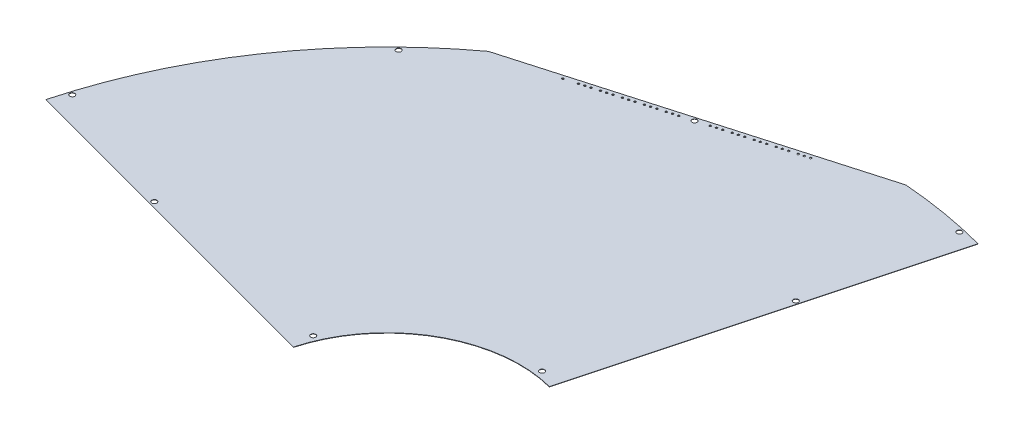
from build123d import *

# Parameters (mm, degrees)
SKETCH1_R      = 2
EXTRUDE1_DEPTH = 0.29
SKETCH2_R      = 0.75
EXTRUDE2_DEPTH = 529.801239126


with BuildPart() as part:
    # Sketch1 → Extrude1 (new body)
    with BuildSketch(Plane(origin=(0, 0, 0), x_dir=(1, 0, 0), z_dir=(0, 1, 0))):
        with BuildLine():
            Line((29.528359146, 379.854019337), (-226.333431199, 306.486831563))
            ThreePointArc((-226.333431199, 306.486831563), (-314.686889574, 214.786315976), (-367.888013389, 99.092934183))
            Line((-367.888013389, 99.092934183), (-101.29165232, 27.658654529))
            ThreePointArc((-101.29165232, 27.658654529), (-52.5, 90.932667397), (26.692728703, 101.550471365))
            Line((26.692728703, 101.550471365), (98.127008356, 368.146832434))
            ThreePointArc((98.127008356, 368.146832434), (64.095536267, 375.569916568), (29.528359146, 379.854019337))
        make_face()
        with Locations(Location((-360.801175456, 112.723164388, 0), (0, 0, 270))):
            Circle(SKETCH1_R, mode=Mode.SUBTRACT)
        with Locations(Location((-262.580864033, 271.910444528, 0), (0, 0, 270))):
            Circle(SKETCH1_R, mode=Mode.SUBTRACT)
        with Locations(Location((-101.180022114, 43.157886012, 0), (0, 0, 270))):
            Circle(SKETCH1_R, mode=Mode.SUBTRACT)
        with Locations(Location((-97.575623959, 340.286640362, 0), (0, 0, 270))):
            Circle(SKETCH1_R, mode=Mode.SUBTRACT)
        with Locations(Location((13.214185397, 109.203412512, 0), (0, 0, 270))):
            Circle(SKETCH1_R, mode=Mode.SUBTRACT)
        with Locations(Location((82.779463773, 368.824565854, 0), (0, 0, 270))):
            Circle(SKETCH1_R, mode=Mode.SUBTRACT)
        with Locations(Location((65.311626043, 257.269268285, 0), (0, 0, 270))):
            Circle(SKETCH1_R, mode=Mode.SUBTRACT)
        with Locations(Location((-255.457534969, 72.073106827, 0), (0, 0, 270))):
            Circle(SKETCH1_R, mode=Mode.SUBTRACT)
    extrude(amount=EXTRUDE1_DEPTH)

    # Sketch2 → Extrude2 (cut, through all)
    with BuildSketch(Plane(origin=(0, 0.29, 0), x_dir=(1, 0, 0), z_dir=(0, 1, 0))):
        with Locations(Location((-87.963007, 343.04301392, 0), (0, 0, 270))):
            Circle(SKETCH2_R)
        with Locations(Location((-74.505343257, 346.901936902, 0), (0, 0, 270))):
            Circle(SKETCH2_R)
        with Locations(Location((-70.660296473, 348.004486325, 0), (0, 0, 270))):
            Circle(SKETCH2_R)
        with Locations(Location((-84.117960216, 344.145563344, 0), (0, 0, 270))):
            Circle(SKETCH2_R)
        with Locations(Location((-80.272913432, 345.248112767, 0), (0, 0, 270))):
            Circle(SKETCH2_R)
        with Locations(Location((-66.815249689, 349.107035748, 0), (0, 0, 270))):
            Circle(SKETCH2_R)
        with Locations(Location((-61.047679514, 350.760859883, 0), (0, 0, 270))):
            Circle(SKETCH2_R)
        with Locations(Location((-57.20263273, 351.863409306, 0), (0, 0, 270))):
            Circle(SKETCH2_R)
        with Locations(Location((-53.357585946, 352.96595873, 0), (0, 0, 270))):
            Circle(SKETCH2_R)
        with Locations(Location((-47.59001577, 354.619782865, 0), (0, 0, 270))):
            Circle(SKETCH2_R)
        with Locations(Location((-43.744968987, 355.722332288, 0), (0, 0, 270))):
            Circle(SKETCH2_R)
        with Locations(Location((-39.899922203, 356.824881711, 0), (0, 0, 270))):
            Circle(SKETCH2_R)
        with Locations(Location((-34.132352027, 358.478705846, 0), (0, 0, 270))):
            Circle(SKETCH2_R)
        with Locations(Location((-30.287305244, 359.581255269, 0), (0, 0, 270))):
            Circle(SKETCH2_R)
        with Locations(Location((-26.44225846, 360.683804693, 0), (0, 0, 270))):
            Circle(SKETCH2_R)
        with Locations(Location((-168.708989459, 319.889476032, 0), (0, 0, 90))):
            Circle(SKETCH2_R)
        with Locations(Location((-164.863942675, 320.992025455, 0), (0, 0, 90))):
            Circle(SKETCH2_R)
        with Locations(Location((-161.018895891, 322.094574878, 0), (0, 0, 90))):
            Circle(SKETCH2_R)
        with Locations(Location((-155.251325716, 323.748399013, 0), (0, 0, 90))):
            Circle(SKETCH2_R)
        with Locations(Location((-151.406278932, 324.850948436, 0), (0, 0, 90))):
            Circle(SKETCH2_R)
        with Locations(Location((-147.561232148, 325.95349786, 0), (0, 0, 90))):
            Circle(SKETCH2_R)
        with Locations(Location((-141.793661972, 327.607321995, 0), (0, 0, 90))):
            Circle(SKETCH2_R)
        with Locations(Location((-137.948615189, 328.709871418, 0), (0, 0, 90))):
            Circle(SKETCH2_R)
        with Locations(Location((-134.103568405, 329.812420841, 0), (0, 0, 90))):
            Circle(SKETCH2_R)
        with Locations(Location((-128.335998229, 331.466244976, 0), (0, 0, 90))):
            Circle(SKETCH2_R)
        with Locations(Location((-114.878334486, 335.325167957, 0), (0, 0, 90))):
            Circle(SKETCH2_R)
        with Locations(Location((-111.033287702, 336.427717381, 0), (0, 0, 90))):
            Circle(SKETCH2_R)
        with Locations(Location((-124.490951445, 332.568794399, 0), (0, 0, 90))):
            Circle(SKETCH2_R)
        with Locations(Location((-120.645904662, 333.671343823, 0), (0, 0, 90))):
            Circle(SKETCH2_R)
        with Locations(Location((-107.188240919, 337.530266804, 0), (0, 0, 90))):
            Circle(SKETCH2_R)
        with Locations(Location((-178.321606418, 317.133102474, 0), (0, 0, 270))):
            Circle(SKETCH2_R)
    extrude(amount=-EXTRUDE2_DEPTH, mode=Mode.SUBTRACT)


solid = part.part
